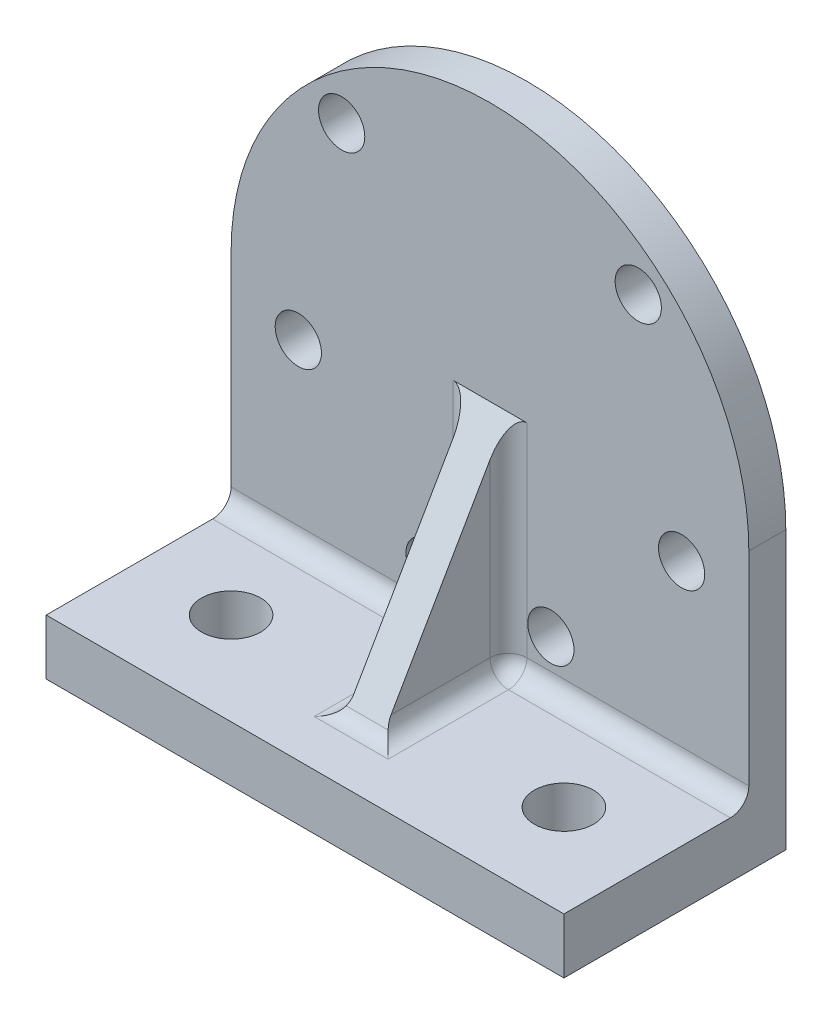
from build123d import *

# Parameters (mm, degrees)
SKETCH_1_W          = 28
SKETCH_1_H          = 26
EXTRUDE_1_DEPTH     = 2
CUT_EXTRUDE_2_DEPTH = 2
SKETCH_4_W          = 28
SKETCH_4_H          = 12
EXTRUDE_2_DEPTH     = 3
FILLET_1_R          = 1
SKETCH_5_R          = 1.6
CUT_EXTRUDE_3_DEPTH = 3
SKETCH_6_R          = 1.25
CUT_EXTRUDE_4_DEPTH = 10
RIB_3_REACH         = 35.586
SKETCH_7_WALL_W     = 83.027828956
SKETCH_7_WALL_H     = 2
FILLET_2_R          = 1


with BuildPart() as part:
    # Sketch 1 → Extrude 1 (new body)
    with BuildSketch(Plane.XY):
        Rectangle(SKETCH_1_W, SKETCH_1_H)
    extrude(amount=EXTRUDE_1_DEPTH)

    # Sketch 3 → Cut-Extrude 2 (cut)
    with BuildSketch(Plane.XY.offset(2)):
        with BuildLine():
            Line((-14, 13), (-14, -1))
            ThreePointArc((-14, -1), (-9.899494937, 8.899494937), (0, 13))
            Line((0, 13), (-14, 13))
        make_face()
        with BuildLine():
            Line((14, 13), (0, 13))
            ThreePointArc((0, 13), (9.899494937, 8.899494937), (14, -1))
            Line((14, -1), (14, 13))
        make_face()
    extrude(amount=-CUT_EXTRUDE_2_DEPTH, mode=Mode.SUBTRACT)

    # Sketch 4 → Extrude 2 (add)
    with BuildSketch(Plane.XZ.offset(13)):
        with Locations((0, 6)):
            Rectangle(SKETCH_4_W, SKETCH_4_H)
    extrude(amount=EXTRUDE_2_DEPTH)

    # Fillet 1
    fillet_1_edges = [part.edges().sort_by_distance(p)[0] for p in [
        (0, -13, 2),
    ]]
    fillet(fillet_1_edges, radius=FILLET_1_R)

    # Sketch 5 → Cut-Extrude 3 (cut)
    with BuildSketch(Plane(origin=(0, -13, 0), x_dir=(1, 0, 0), z_dir=(0, 1, 0))):
        with Locations(Location((-9, -7, 0), (0, 0, 270))):
            Circle(SKETCH_5_R)
        with Locations(Location((9, -7, 0), (0, 0, 270))):
            Circle(SKETCH_5_R)
    extrude(amount=-CUT_EXTRUDE_3_DEPTH, mode=Mode.SUBTRACT)

    # Sketch 6 → Cut-Extrude 4 (cut)
    with BuildSketch(Plane(origin=(0, 0, 0), x_dir=(-1, 0, 0), z_dir=(0, 0, -1))):
        with Locations(Location((3.293607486, -10.364675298, 0), (0, 0, 180))):
            Circle(SKETCH_6_R)
        with Locations(Location((10.364675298, -3.293607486, 0), (0, 0, 180))):
            Circle(SKETCH_6_R)
        with Locations((8.020101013, 8.020101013)):
            Circle(SKETCH_6_R)
        with Locations((-10.364675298, -3.293607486)):
            Circle(SKETCH_6_R)
        with Locations((-3.293607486, -10.364675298)):
            Circle(SKETCH_6_R)
        with Locations(Location((-8.020101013, 8.020101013, 0), (0, 0, 180))):
            Circle(SKETCH_6_R)
    extrude(amount=-CUT_EXTRUDE_4_DEPTH, mode=Mode.SUBTRACT)

    # Sketch 7 wall → Rib 3 (add, up to next)
    with BuildSketch(Plane(origin=(0, -7, 5.464101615), x_dir=(0, 0.866025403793, -0.499999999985), z_dir=(0, 0.499999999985, 0.866025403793)), mode=Mode.PRIVATE) as rib_3_sk1:
        Rectangle(SKETCH_7_WALL_W, SKETCH_7_WALL_H)
    rib_3_tool1 = extrude(rib_3_sk1.sketch, amount=-RIB_3_REACH, mode=Mode.PRIVATE) - part.part
    add(rib_3_tool1.solids().sort_by_distance((0, -7, 5.464101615))[0])

    # Fillet 2
    fillet_2_edges = [part.edges().sort_by_distance(p)[0] for p in [
        (-1, -13, 5.964101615),
        (-1, -6.5, 2),
        (0, -13, 8.92820323),
        (1, -6.5, 2),
        (1, -13, 5.964101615),
        (-1, -12.707106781, 2.292893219),
        (1, -12.707106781, 2.292893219),
    ]]
    fillet(fillet_2_edges, radius=FILLET_2_R)


solid = part.part
